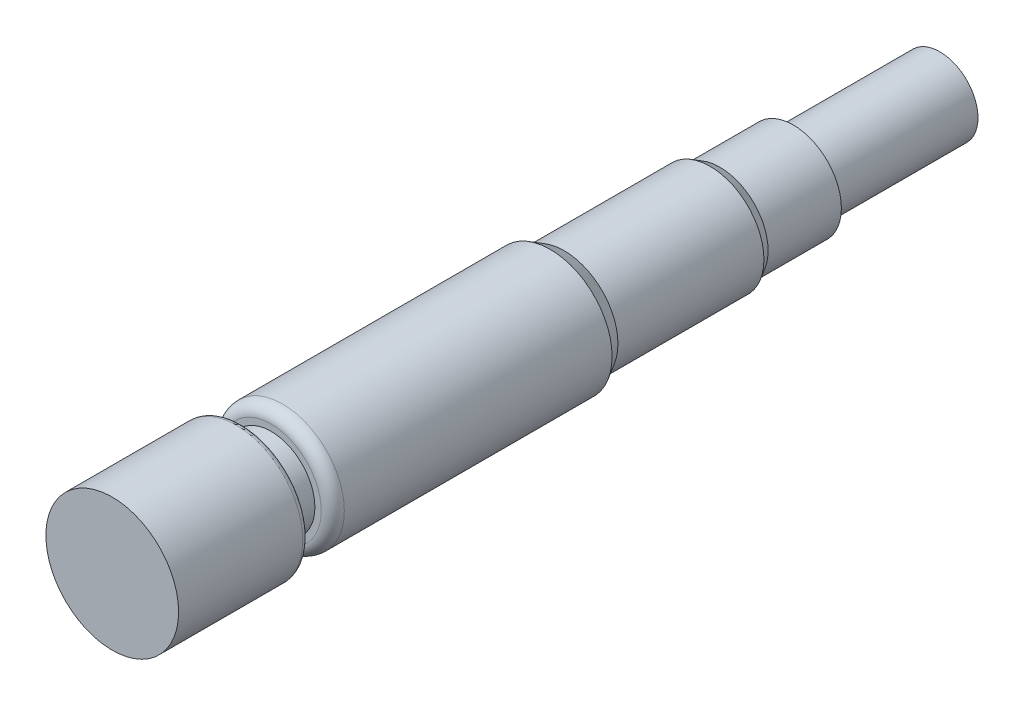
ISO-10303-21;
HEADER;
FILE_DESCRIPTION(('STEP AP214'),'2;1');
FILE_NAME('part.step','',(''),(''),'','','');
FILE_SCHEMA(('AUTOMOTIVE_DESIGN { 1 0 10303 214 1 1 1 1 }'));
ENDSEC;
DATA;
#1=APPLICATION_CONTEXT('core data for automotive mechanical design processes');
#2=APPLICATION_PROTOCOL_DEFINITION('international standard','automotive_design',2000,#1);
#3=PRODUCT_CONTEXT('',#1,'mechanical');
#4=PRODUCT('Part','Part','',(#3));
#5=PRODUCT_RELATED_PRODUCT_CATEGORY('part','',(#4));
#6=PRODUCT_DEFINITION_FORMATION('','',#4);
#7=PRODUCT_DEFINITION_CONTEXT('part definition',#1,'design');
#8=PRODUCT_DEFINITION('design','',#6,#7);
#9=PRODUCT_DEFINITION_SHAPE('','',#8);
#10=(LENGTH_UNIT() NAMED_UNIT(*) SI_UNIT(.MILLI.,.METRE.));
#11=(NAMED_UNIT(*) PLANE_ANGLE_UNIT() SI_UNIT($,.RADIAN.));
#12=(NAMED_UNIT(*) SI_UNIT($,.STERADIAN.) SOLID_ANGLE_UNIT());
#13=UNCERTAINTY_MEASURE_WITH_UNIT(LENGTH_MEASURE(1.E-05),#10,'distance_accuracy_value','');
#14=(GEOMETRIC_REPRESENTATION_CONTEXT(3) GLOBAL_UNCERTAINTY_ASSIGNED_CONTEXT((#13)) GLOBAL_UNIT_ASSIGNED_CONTEXT((#10,
#11,#12)) REPRESENTATION_CONTEXT('',''));
#15=CARTESIAN_POINT('',(0.,0.,0.));
#16=DIRECTION('',(0.,0.,1.));
#17=DIRECTION('',(1.,0.,0.));
#18=AXIS2_PLACEMENT_3D('',#15,#16,#17);
#19=CARTESIAN_POINT('',(0.,0.,-71.71));
#20=DIRECTION('',(0.,0.,-1.));
#21=DIRECTION('',(-1.,0.,0.));
#22=AXIS2_PLACEMENT_3D('',#19,#20,#21);
#23=PLANE('',#22);
#24=CARTESIAN_POINT('',(0.,0.,-71.71));
#25=DIRECTION('',(0.,0.,1.));
#26=DIRECTION('',(1.,0.,0.));
#27=AXIS2_PLACEMENT_3D('',#24,#25,#26);
#28=CIRCLE('',#27,3.30480958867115);
#29=CARTESIAN_POINT('',(3.30480958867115,0.,-71.71));
#30=VERTEX_POINT('',#29);
#31=EDGE_CURVE('E116',#30,#30,#28,.T.);
#32=ORIENTED_EDGE('',*,*,#31,.F.);
#33=EDGE_LOOP('',(#32));
#34=FACE_BOUND('',#33,.T.);
#35=ADVANCED_FACE('F17',(#34),#23,.T.);
#36=CARTESIAN_POINT('',(0.,0.,0.));
#37=DIRECTION('',(0.,0.,1.));
#38=DIRECTION('',(1.,0.,0.));
#39=AXIS2_PLACEMENT_3D('',#36,#37,#38);
#40=PLANE('',#39);
#41=CARTESIAN_POINT('',(0.,0.,0.));
#42=DIRECTION('',(0.,0.,1.));
#43=DIRECTION('',(1.,0.,0.));
#44=AXIS2_PLACEMENT_3D('',#41,#42,#43);
#45=CIRCLE('',#44,5.75);
#46=CARTESIAN_POINT('',(5.75,0.,0.));
#47=VERTEX_POINT('',#46);
#48=EDGE_CURVE('E113',#47,#47,#45,.F.);
#49=ORIENTED_EDGE('',*,*,#48,.F.);
#50=EDGE_LOOP('',(#49));
#51=FACE_BOUND('',#50,.T.);
#52=ADVANCED_FACE('F297',(#51),#40,.T.);
#53=CARTESIAN_POINT('',(0.,0.,-71.71));
#54=DIRECTION('',(0.,0.,1.));
#55=DIRECTION('',(1.,0.,0.));
#56=AXIS2_PLACEMENT_3D('',#53,#54,#55);
#57=CYLINDRICAL_SURFACE('',#56,3.30480958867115);
#58=CARTESIAN_POINT('',(0.,0.,-59.01));
#59=DIRECTION('',(0.,0.,1.));
#60=DIRECTION('',(1.,0.,0.));
#61=AXIS2_PLACEMENT_3D('',#58,#59,#60);
#62=CIRCLE('',#61,3.30480958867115);
#63=CARTESIAN_POINT('',(3.30480958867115,0.,-59.01));
#64=VERTEX_POINT('',#63);
#65=EDGE_CURVE('E101',#64,#64,#62,.T.);
#66=ORIENTED_EDGE('',*,*,#65,.F.);
#67=EDGE_LOOP('',(#66));
#68=FACE_BOUND('',#67,.T.);
#69=ORIENTED_EDGE('',*,*,#31,.T.);
#70=EDGE_LOOP('',(#69));
#71=FACE_BOUND('',#70,.T.);
#72=ADVANCED_FACE('F194',(#68,#71),#57,.T.);
#73=CARTESIAN_POINT('',(0.,0.,-11.26));
#74=DIRECTION('',(0.,0.,1.));
#75=DIRECTION('',(1.,0.,0.));
#76=AXIS2_PLACEMENT_3D('',#73,#74,#75);
#77=CYLINDRICAL_SURFACE('',#76,5.75);
#78=CARTESIAN_POINT('',(0.,0.,-10.76));
#79=DIRECTION('',(0.,0.,1.));
#80=DIRECTION('',(1.,0.,0.));
#81=AXIS2_PLACEMENT_3D('',#78,#79,#80);
#82=CIRCLE('',#81,5.75);
#83=CARTESIAN_POINT('',(5.75,0.,-10.76));
#84=VERTEX_POINT('',#83);
#85=EDGE_CURVE('E93',#84,#84,#82,.F.);
#86=ORIENTED_EDGE('',*,*,#85,.F.);
#87=EDGE_LOOP('',(#86));
#88=FACE_BOUND('',#87,.T.);
#89=ORIENTED_EDGE('',*,*,#48,.T.);
#90=EDGE_LOOP('',(#89));
#91=FACE_BOUND('',#90,.T.);
#92=ADVANCED_FACE('F188',(#88,#91),#77,.T.);
#93=CARTESIAN_POINT('',(0.,0.,-59.01));
#94=DIRECTION('',(0.,0.,-1.));
#95=DIRECTION('',(-1.,0.,0.));
#96=AXIS2_PLACEMENT_3D('',#93,#94,#95);
#97=PLANE('',#96);
#98=ORIENTED_EDGE('',*,*,#65,.T.);
#99=EDGE_LOOP('',(#98));
#100=FACE_BOUND('',#99,.T.);
#101=CARTESIAN_POINT('',(0.,0.,-59.01));
#102=DIRECTION('',(0.,0.,1.));
#103=DIRECTION('',(1.,0.,0.));
#104=AXIS2_PLACEMENT_3D('',#101,#102,#103);
#105=CIRCLE('',#104,4.16643194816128);
#106=CARTESIAN_POINT('',(4.16643194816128,0.,-59.01));
#107=VERTEX_POINT('',#106);
#108=EDGE_CURVE('E53',#107,#107,#105,.T.);
#109=ORIENTED_EDGE('',*,*,#108,.F.);
#110=EDGE_LOOP('',(#109));
#111=FACE_BOUND('',#110,.T.);
#112=ADVANCED_FACE('F86',(#100,#111),#97,.T.);
#113=CARTESIAN_POINT('',(0.,0.,-10.76));
#114=DIRECTION('',(0.,0.,1.));
#115=DIRECTION('',(1.,0.,0.));
#116=AXIS2_PLACEMENT_3D('',#113,#114,#115);
#117=TOROIDAL_SURFACE('',#116,5.25,0.5);
#118=CARTESIAN_POINT('',(0.,0.,-11.26));
#119=DIRECTION('',(0.,0.,1.));
#120=DIRECTION('',(1.,0.,0.));
#121=AXIS2_PLACEMENT_3D('',#118,#119,#120);
#122=CIRCLE('',#121,5.25);
#123=CARTESIAN_POINT('',(5.25,0.,-11.26));
#124=VERTEX_POINT('',#123);
#125=CARTESIAN_POINT('',(-5.25,0.,-11.26));
#126=VERTEX_POINT('',#125);
#127=EDGE_CURVE('E48',#124,#126,#122,.T.);
#128=ORIENTED_EDGE('',*,*,#127,.T.);
#129=CARTESIAN_POINT('',(0.,0.,-11.26));
#130=DIRECTION('',(0.,0.,1.));
#131=DIRECTION('',(-1.,0.,0.));
#132=AXIS2_PLACEMENT_3D('',#129,#130,#131);
#133=CIRCLE('',#132,5.25);
#134=EDGE_CURVE('E45',#126,#124,#133,.T.);
#135=ORIENTED_EDGE('',*,*,#134,.T.);
#136=EDGE_LOOP('',(#128,#135));
#137=FACE_BOUND('',#136,.T.);
#138=ORIENTED_EDGE('',*,*,#85,.T.);
#139=EDGE_LOOP('',(#138));
#140=FACE_BOUND('',#139,.T.);
#141=ADVANCED_FACE('F49',(#137,#140),#117,.T.);
#142=CARTESIAN_POINT('',(0.,0.,-59.01));
#143=DIRECTION('',(0.,0.,1.));
#144=DIRECTION('',(1.,0.,0.));
#145=AXIS2_PLACEMENT_3D('',#142,#143,#144);
#146=CYLINDRICAL_SURFACE('',#145,4.16643194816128);
#147=CARTESIAN_POINT('',(0.,0.,-52.660000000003));
#148=DIRECTION('',(0.,0.,1.));
#149=DIRECTION('',(1.,0.,0.));
#150=AXIS2_PLACEMENT_3D('',#147,#148,#149);
#151=CIRCLE('',#150,4.1664319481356);
#152=CARTESIAN_POINT('',(4.1664319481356,0.,-52.660000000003));
#153=VERTEX_POINT('',#152);
#154=EDGE_CURVE('E57',#153,#153,#151,.T.);
#155=ORIENTED_EDGE('',*,*,#154,.F.);
#156=EDGE_LOOP('',(#155));
#157=FACE_BOUND('',#156,.T.);
#158=ORIENTED_EDGE('',*,*,#108,.T.);
#159=EDGE_LOOP('',(#158));
#160=FACE_BOUND('',#159,.T.);
#161=ADVANCED_FACE('F77',(#157,#160),#146,.T.);
#162=CARTESIAN_POINT('',(0.,0.,-11.26));
#163=DIRECTION('',(0.,0.,1.));
#164=DIRECTION('',(1.,0.,0.));
#165=AXIS2_PLACEMENT_3D('',#162,#163,#164);
#166=PLANE('',#165);
#167=CARTESIAN_POINT('',(0.,0.,-11.26));
#168=DIRECTION('',(0.,0.,1.));
#169=DIRECTION('',(1.,0.,0.));
#170=AXIS2_PLACEMENT_3D('',#167,#168,#169);
#171=CIRCLE('',#170,3.8);
#172=CARTESIAN_POINT('',(3.8,0.,-11.26));
#173=VERTEX_POINT('',#172);
#174=EDGE_CURVE('E106',#173,#173,#171,.F.);
#175=ORIENTED_EDGE('',*,*,#174,.F.);
#176=EDGE_LOOP('',(#175));
#177=FACE_BOUND('',#176,.T.);
#178=ORIENTED_EDGE('',*,*,#127,.F.);
#179=ORIENTED_EDGE('',*,*,#134,.F.);
#180=EDGE_LOOP('',(#178,#179));
#181=FACE_BOUND('',#180,.T.);
#182=ADVANCED_FACE('F56',(#177,#181),#166,.F.);
#183=CARTESIAN_POINT('',(0.,0.,-51.8100000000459));
#184=DIRECTION('',(0.,0.,1.));
#185=DIRECTION('',(1.,0.,0.));
#186=AXIS2_PLACEMENT_3D('',#183,#184,#185);
#187=CONICAL_SURFACE('',#186,4.6571796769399,0.523598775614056);
#188=CARTESIAN_POINT('',(0.,0.,-51.81));
#189=DIRECTION('',(0.,0.,1.));
#190=DIRECTION('',(1.,0.,0.));
#191=AXIS2_PLACEMENT_3D('',#188,#189,#190);
#192=CIRCLE('',#191,4.65717967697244);
#193=CARTESIAN_POINT('',(4.65717967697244,0.,-51.81));
#194=VERTEX_POINT('',#193);
#195=EDGE_CURVE('E105',#194,#194,#192,.T.);
#196=ORIENTED_EDGE('',*,*,#195,.F.);
#197=EDGE_LOOP('',(#196));
#198=FACE_BOUND('',#197,.T.);
#199=ORIENTED_EDGE('',*,*,#154,.T.);
#200=EDGE_LOOP('',(#199));
#201=FACE_BOUND('',#200,.T.);
#202=ADVANCED_FACE('F76',(#198,#201),#187,.T.);
#203=CARTESIAN_POINT('',(0.,0.,-13.76));
#204=DIRECTION('',(0.,0.,1.));
#205=DIRECTION('',(1.,0.,0.));
#206=AXIS2_PLACEMENT_3D('',#203,#204,#205);
#207=CYLINDRICAL_SURFACE('',#206,3.8);
#208=CARTESIAN_POINT('',(0.,0.,-13.76));
#209=DIRECTION('',(0.,0.,1.));
#210=DIRECTION('',(1.,0.,0.));
#211=AXIS2_PLACEMENT_3D('',#208,#209,#210);
#212=CIRCLE('',#211,3.8);
#213=CARTESIAN_POINT('',(3.8,0.,-13.76));
#214=VERTEX_POINT('',#213);
#215=EDGE_CURVE('E102',#214,#214,#212,.T.);
#216=ORIENTED_EDGE('',*,*,#215,.T.);
#217=EDGE_LOOP('',(#216));
#218=FACE_BOUND('',#217,.T.);
#219=ORIENTED_EDGE('',*,*,#174,.T.);
#220=EDGE_LOOP('',(#219));
#221=FACE_BOUND('',#220,.T.);
#222=ADVANCED_FACE('F211',(#218,#221),#207,.T.);
#223=CARTESIAN_POINT('',(0.,0.,-52.66));
#224=DIRECTION('',(0.,0.,1.));
#225=DIRECTION('',(1.,0.,0.));
#226=AXIS2_PLACEMENT_3D('',#223,#224,#225);
#227=CYLINDRICAL_SURFACE('',#226,4.65717967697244);
#228=CARTESIAN_POINT('',(0.,0.,-39.1599999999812));
#229=DIRECTION('',(0.,0.,1.));
#230=DIRECTION('',(1.,0.,0.));
#231=AXIS2_PLACEMENT_3D('',#228,#229,#230);
#232=CIRCLE('',#231,4.65717967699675);
#233=CARTESIAN_POINT('',(4.65717967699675,0.,-39.1599999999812));
#234=VERTEX_POINT('',#233);
#235=EDGE_CURVE('E143',#234,#234,#232,.T.);
#236=ORIENTED_EDGE('',*,*,#235,.F.);
#237=EDGE_LOOP('',(#236));
#238=FACE_BOUND('',#237,.T.);
#239=ORIENTED_EDGE('',*,*,#195,.T.);
#240=EDGE_LOOP('',(#239));
#241=FACE_BOUND('',#240,.T.);
#242=ADVANCED_FACE('F160',(#238,#241),#227,.T.);
#243=CARTESIAN_POINT('',(0.,0.,-13.76));
#244=DIRECTION('',(0.,0.,-1.));
#245=DIRECTION('',(-1.,0.,0.));
#246=AXIS2_PLACEMENT_3D('',#243,#244,#245);
#247=PLANE('',#246);
#248=ORIENTED_EDGE('',*,*,#215,.F.);
#249=EDGE_LOOP('',(#248));
#250=FACE_BOUND('',#249,.T.);
#251=CARTESIAN_POINT('',(0.,0.,-13.76));
#252=DIRECTION('',(0.,0.,-1.));
#253=DIRECTION('',(-1.,0.,0.));
#254=AXIS2_PLACEMENT_3D('',#251,#252,#253);
#255=CIRCLE('',#254,4.35);
#256=CARTESIAN_POINT('',(-4.35,0.,-13.76));
#257=VERTEX_POINT('',#256);
#258=CARTESIAN_POINT('',(4.35,0.,-13.76));
#259=VERTEX_POINT('',#258);
#260=EDGE_CURVE('E146',#257,#259,#255,.T.);
#261=ORIENTED_EDGE('',*,*,#260,.F.);
#262=CARTESIAN_POINT('',(0.,0.,-13.76));
#263=DIRECTION('',(0.,0.,-1.));
#264=DIRECTION('',(1.,0.,0.));
#265=AXIS2_PLACEMENT_3D('',#262,#263,#264);
#266=CIRCLE('',#265,4.35);
#267=EDGE_CURVE('E36',#259,#257,#266,.T.);
#268=ORIENTED_EDGE('',*,*,#267,.F.);
#269=EDGE_LOOP('',(#261,#268));
#270=FACE_BOUND('',#269,.T.);
#271=ADVANCED_FACE('F151',(#250,#270),#247,.F.);
#272=CARTESIAN_POINT('',(0.,0.,-37.9600000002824));
#273=DIRECTION('',(0.,0.,1.));
#274=DIRECTION('',(1.,0.,0.));
#275=AXIS2_PLACEMENT_3D('',#272,#273,#274);
#276=CONICAL_SURFACE('',#275,5.34999999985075,0.523598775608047);
#277=CARTESIAN_POINT('',(0.,0.,-37.96));
#278=DIRECTION('',(0.,0.,1.));
#279=DIRECTION('',(1.,0.,0.));
#280=AXIS2_PLACEMENT_3D('',#277,#278,#279);
#281=CIRCLE('',#280,5.35);
#282=CARTESIAN_POINT('',(5.35,0.,-37.96));
#283=VERTEX_POINT('',#282);
#284=EDGE_CURVE('E28',#283,#283,#281,.T.);
#285=ORIENTED_EDGE('',*,*,#284,.F.);
#286=EDGE_LOOP('',(#285));
#287=FACE_BOUND('',#286,.T.);
#288=ORIENTED_EDGE('',*,*,#235,.T.);
#289=EDGE_LOOP('',(#288));
#290=FACE_BOUND('',#289,.T.);
#291=ADVANCED_FACE('F135',(#287,#290),#276,.T.);
#292=CARTESIAN_POINT('',(0.,0.,-14.76));
#293=DIRECTION('',(0.,0.,-1.));
#294=DIRECTION('',(-1.,0.,0.));
#295=AXIS2_PLACEMENT_3D('',#292,#293,#294);
#296=TOROIDAL_SURFACE('',#295,4.35,1.);
#297=CARTESIAN_POINT('',(0.,0.,-14.76));
#298=DIRECTION('',(0.,0.,1.));
#299=DIRECTION('',(1.,0.,0.));
#300=AXIS2_PLACEMENT_3D('',#297,#298,#299);
#301=CIRCLE('',#300,5.35);
#302=CARTESIAN_POINT('',(5.35,0.,-14.76));
#303=VERTEX_POINT('',#302);
#304=EDGE_CURVE('E11',#303,#303,#301,.F.);
#305=ORIENTED_EDGE('',*,*,#304,.F.);
#306=EDGE_LOOP('',(#305));
#307=FACE_BOUND('',#306,.T.);
#308=ORIENTED_EDGE('',*,*,#260,.T.);
#309=ORIENTED_EDGE('',*,*,#267,.T.);
#310=EDGE_LOOP('',(#308,#309));
#311=FACE_BOUND('',#310,.T.);
#312=ADVANCED_FACE('F123',(#307,#311),#296,.T.);
#313=CARTESIAN_POINT('',(0.,0.,-39.16));
#314=DIRECTION('',(0.,0.,1.));
#315=DIRECTION('',(1.,0.,0.));
#316=AXIS2_PLACEMENT_3D('',#313,#314,#315);
#317=CYLINDRICAL_SURFACE('',#316,5.35);
#318=ORIENTED_EDGE('',*,*,#304,.T.);
#319=EDGE_LOOP('',(#318));
#320=FACE_BOUND('',#319,.T.);
#321=ORIENTED_EDGE('',*,*,#284,.T.);
#322=EDGE_LOOP('',(#321));
#323=FACE_BOUND('',#322,.T.);
#324=ADVANCED_FACE('F134',(#320,#323),#317,.T.);
#325=CLOSED_SHELL('',(#35,#52,#72,#92,#112,#141,#161,#182,#202,#222,#242,#271,#291,#312,#324));
#326=MANIFOLD_SOLID_BREP('B1',#325);
#327=ADVANCED_BREP_SHAPE_REPRESENTATION('',(#18,#326),#14);
#328=SHAPE_DEFINITION_REPRESENTATION(#9,#327);
ENDSEC;
END-ISO-10303-21;
